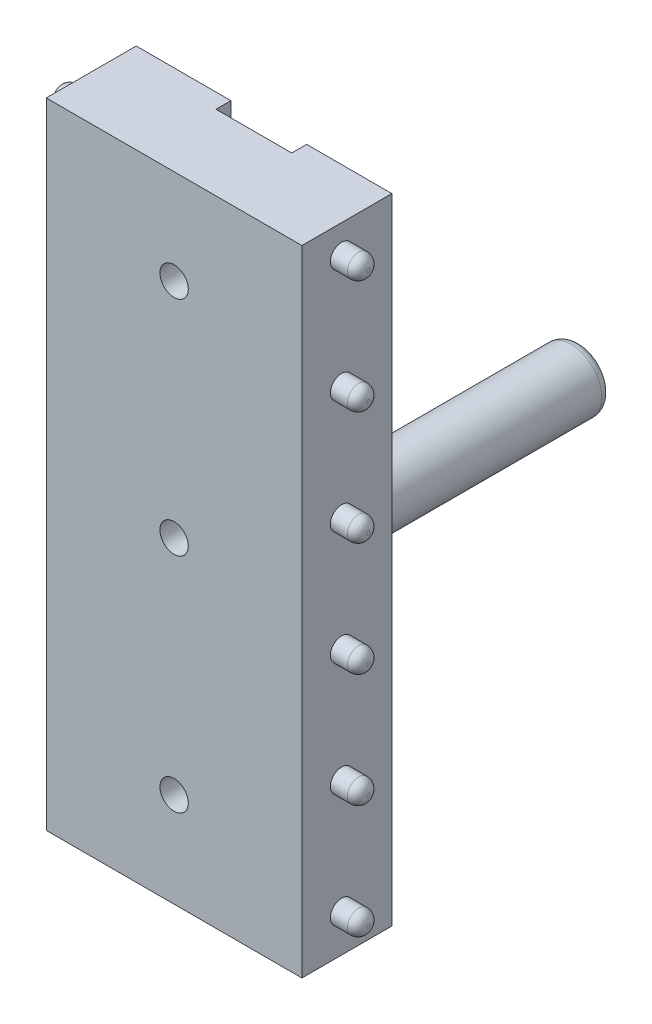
from build123d import *

# Parameters (mm, degrees)
EXTRUSION1_DEPTH        = 67
ESQUISSE2_R             = 3.25
EXTRUSION2_DEPTH        = 35
ESQUISSE3_R             = 1.2
EXTRUSION3_DEPTH        = 2.8
CONG_1_R                = 1
CONG_2_R                = 1
CONG_2_OF_SYM_TRIE1_R   = 1
ESQUISSE5_R             = 1.5
ENL_V_MAT_EXTRU_1_DEPTH = 10


with BuildPart() as part:
    # Esquisse1 → Extrusion1 (new body)
    with BuildSketch(Plane(origin=(0, 0, 0), x_dir=(1, 0, 0), z_dir=(0, 1, 0))):
        Polygon((0, 0), (27, 0), (27, 9.5), (18, 9.5), (18, 7.928079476), (10, 7.928079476), (10, 9.5), (0, 9.5), align=None)
    extrude(amount=EXTRUSION1_DEPTH)

    # Esquisse2 → Extrusion2 (add)
    with BuildSketch(Plane(origin=(0, 0, -7.928079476), x_dir=(-1, 0, 0), z_dir=(0, 0, -1))):
        with Locations(Location((-13.5, 27, 0), (0, 0, 180))):
            Circle(ESQUISSE2_R)
    extrude(amount=EXTRUSION2_DEPTH)

    # Esquisse3 → Extrusion3 (add)
    with BuildSketch(Plane(origin=(27, 0, 0), x_dir=(0, 0, -1), z_dir=(1, 0, 0))):
        with Locations(Location((4.2, 64, 0), (0, 0, 180))):
            Circle(ESQUISSE3_R)
        with Locations(Location((4.2, 52, 0), (0, 0, 180))):
            Circle(ESQUISSE3_R)
        with Locations(Location((4.2, 40, 0), (0, 0, 180))):
            Circle(ESQUISSE3_R)
        with Locations(Location((4.2, 28, 0), (0, 0, 180))):
            Circle(ESQUISSE3_R)
        with Locations(Location((4.2, 16, 0), (0, 0, 180))):
            Circle(ESQUISSE3_R)
        with Locations(Location((4.2, 4, 0), (0, 0, 180))):
            Circle(ESQUISSE3_R)
    extrusion3 = extrude(amount=EXTRUSION3_DEPTH)

    # Cong_1
    cong_1_edges = [part.edges().sort_by_distance(p)[0] for p in [
        (10.25, 27, -42.928079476),
    ]]
    fillet(cong_1_edges, radius=CONG_1_R)

    # Cong_2
    cong_2_edges = [part.edges().sort_by_distance(p)[0] for p in [
        (29.8, 64, -5.4),
        (29.8, 52, -5.4),
        (29.8, 40, -5.4),
        (29.8, 28, -5.4),
        (29.8, 16, -5.4),
        (29.8, 4, -5.4),
    ]]
    fillet(cong_2_edges, radius=CONG_2_R)

    # Sym_trie1: Extrusion3 across plane
    add(extrusion3.mirror(Plane(origin=(13.5, 0, 0), x_dir=(0, 0, 1), z_dir=(1, 0, 0))))

    # Cong_2 of Sym_trie1
    cong_2_of_sym_trie1_edges = [part.edges().sort_by_distance(p)[0] for p in [
        (-2.8, 64, -5.4),
        (-2.8, 52, -5.4),
        (-2.8, 40, -5.4),
        (-2.8, 28, -5.4),
        (-2.8, 16, -5.4),
        (-2.8, 4, -5.4),
    ]]
    fillet(cong_2_of_sym_trie1_edges, radius=CONG_2_OF_SYM_TRIE1_R)

    # Esquisse5 → Enl_v. mat.-Extru.1 (cut)
    with BuildSketch(Plane.XY):
        with Locations((13.5, 57)):
            Circle(ESQUISSE5_R)
        with Locations((13.5, 10)):
            Circle(ESQUISSE5_R)
        with Locations((13.5, 33.5)):
            Circle(ESQUISSE5_R)
    extrude(amount=-ENL_V_MAT_EXTRU_1_DEPTH, mode=Mode.SUBTRACT)


solid = part.part
